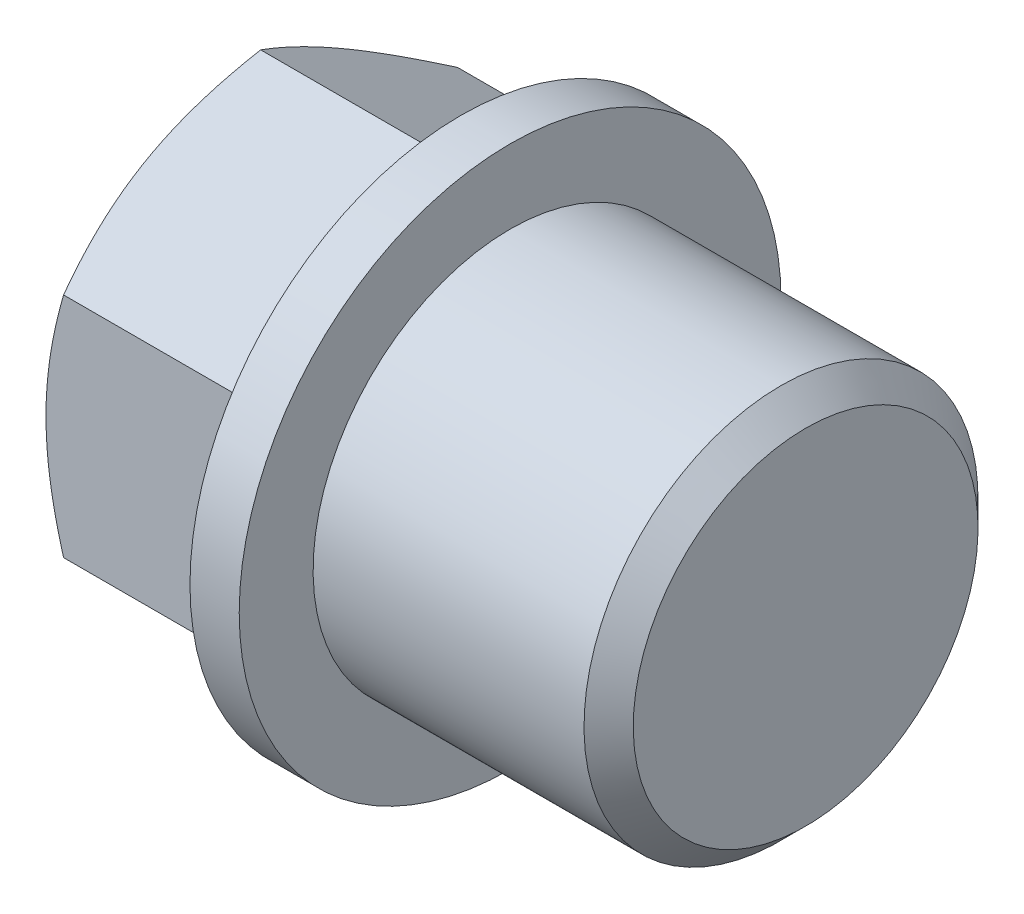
from build123d import *

# Parameters (mm, degrees)
SKETCH2_OUTSIDE_W  = 31.858
SKETCH2_OUTSIDE_H  = 31.858
CUT_EXTRUDE1_DEPTH = 10
CHAMFER1_SIZE      = 1


with BuildPart() as part:
    # Sketch1 → Revolve1 (revolve)
    with BuildSketch(Plane.XY):
        Polygon((0, 0), (0, 9.2376), (10, 9.2376), (10, 11), (12, 11), (12, 8), (24, 8), (24, 0), align=None)
    revolve(axis=Axis((60.817282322, 0, 0), (-1, 0, 0)))

    # Sketch2 outside → Cut-Extrude1 (cut)
    with BuildSketch(Plane.ZY):
        Rectangle(SKETCH2_OUTSIDE_W, SKETCH2_OUTSIDE_H)
        Polygon((0, 9.2376), (-7.99999627, 4.6188), (-7.99999627, -4.6188), (0, -9.2376), (7.99999627, -4.6188), (7.99999627, 4.6188), align=None, mode=Mode.SUBTRACT)
    extrude(amount=-CUT_EXTRUDE1_DEPTH, mode=Mode.SUBTRACT)

    # Chamfer1
    chamfer1_edges = [part.edges().sort_by_distance(p)[0] for p in [
        (24, -8, 0),
    ]]
    chamfer(chamfer1_edges, length=CHAMFER1_SIZE)

    # Sketch3 → Cut-Revolve1 (revolve, cut)
    with BuildSketch(Plane.XY, mode=Mode.PRIVATE) as cut_revolve1_sk:
        Polygon((0, 10.5), (0, 6), (2.598076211, 10.5), align=None)
    revolve(cut_revolve1_sk.sketch.rotate(Axis((-1.972440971, 0, 0), (1, 0, 0)), 300.000000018), axis=Axis((-1.972440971, 0, 0), (1, 0, 0)), mode=Mode.SUBTRACT)


solid = part.part
